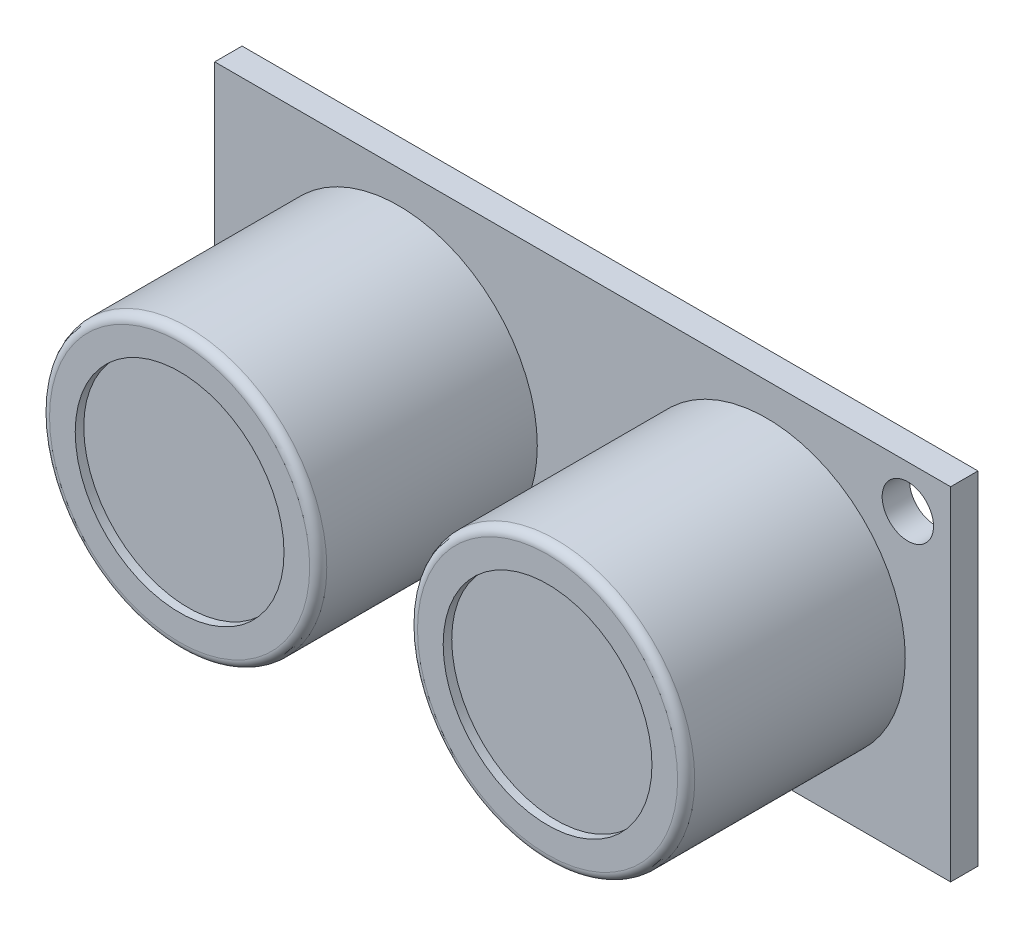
from build123d import *

# Parameters (mm, degrees)
ESQUISSE1_W             = 43
ESQUISSE1_H             = 20
ESQUISSE1_R             = 1.5
EXTRUSION1_DEPTH        = 1.6
ESQUISSE2_R             = 8.1
EXTRUSION2_DEPTH        = 12.8
ESQUISSE3_R             = 6.1
ENL_V_MAT_EXTRU_1_DEPTH = 0.5
CONG_1_R                = 0.5
CONG_1_OF_SYM_TRIE1_R   = 0.5
ESQUISSE4_W             = 12.8
ESQUISSE4_H             = 2.5
EXTRUSION3_DEPTH        = 2.5
ESQUISSE6_R             = 0.3


with BuildPart() as part:
    # Esquisse1 → Extrusion1 (new body)
    with BuildSketch(Plane.XY):
        with Locations((21.5, 10)):
            Rectangle(ESQUISSE1_W, ESQUISSE1_H)
        with Locations((2.5, 2.5)):
            Circle(ESQUISSE1_R, mode=Mode.SUBTRACT)
        with Locations((40.5, 17.5)):
            Circle(ESQUISSE1_R, mode=Mode.SUBTRACT)
    extrude(amount=EXTRUSION1_DEPTH)

    # Esquisse2 → Extrusion2 (add)
    with BuildSketch(Plane.XY.offset(1.6)):
        with Locations(Location((32.25, 10, 0), (0, 0, 180))):
            Circle(ESQUISSE2_R)
    extrusion2 = extrude(amount=EXTRUSION2_DEPTH)

    # Esquisse3 → Enl_v. mat.-Extru.1 (cut)
    with BuildSketch(Plane.XY.offset(14.4)):
        with Locations((32.25, 10)):
            Circle(ESQUISSE3_R)
    enl_v_mat_extru_1 = extrude(amount=-ENL_V_MAT_EXTRU_1_DEPTH, mode=Mode.SUBTRACT)

    # Cong_1
    cong_1_edges = [part.edges().sort_by_distance(p)[0] for p in [
        (40.35, 10, 14.4),
    ]]
    fillet(cong_1_edges, radius=CONG_1_R)

    # Sym_trie1: Extrusion2, Enl_v. mat.-Extru.1 across plane
    add(extrusion2.mirror(Plane(origin=(21.5, 0, 0), x_dir=(0, 0, 1), z_dir=(1, 0, 0))))
    add(enl_v_mat_extru_1.mirror(Plane(origin=(21.5, 0, 0), x_dir=(0, 0, 1), z_dir=(1, 0, 0))), mode=Mode.SUBTRACT)

    # Cong_1 of Sym_trie1
    cong_1_of_sym_trie1_edges = [part.edges().sort_by_distance(p)[0] for p in [
        (2.65, 10, 14.4),
    ]]
    fillet(cong_1_of_sym_trie1_edges, radius=CONG_1_OF_SYM_TRIE1_R)

    # Esquisse4 → Extrusion3 (add)
    with BuildSketch(Plane(origin=(0, 0, 0), x_dir=(-1, 0, 0), z_dir=(0, 0, -1))):
        with Locations((-21.5, 1.25)):
            Rectangle(ESQUISSE4_W, ESQUISSE4_H)
    extrude(amount=EXTRUSION3_DEPTH)

    # Balayage1: sweep along a path in Esquisse7
    with BuildLine(Plane(origin=(21.5, 0, 0), x_dir=(0, 0, -1), z_dir=(1, 0, 0))) as balayage1_path:
        Line((2.5, 1.25), (5, 1.25))
        ThreePointArc((5, 1.25), (5.353553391, 1.103553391), (5.5, 0.75))
        Line((5.5, 0.75), (5.5, -2))
    # Esquisse6 → Balayage1 (sweep)
    with BuildSketch(Plane(origin=(0, 0, -2.5), x_dir=(-1, 0, 0), z_dir=(0, 0, -1))):
        with Locations((-21.5, 1.25)):
            Circle(ESQUISSE6_R)
        with Locations((-18.96, 1.25)):
            Circle(ESQUISSE6_R)
        with Locations((-16.42, 1.25)):
            Circle(ESQUISSE6_R)
        with Locations((-26.58, 1.25)):
            Circle(ESQUISSE6_R)
        with Locations((-24.04, 1.25)):
            Circle(ESQUISSE6_R)
    sweep(path=balayage1_path.line)


solid = part.part
